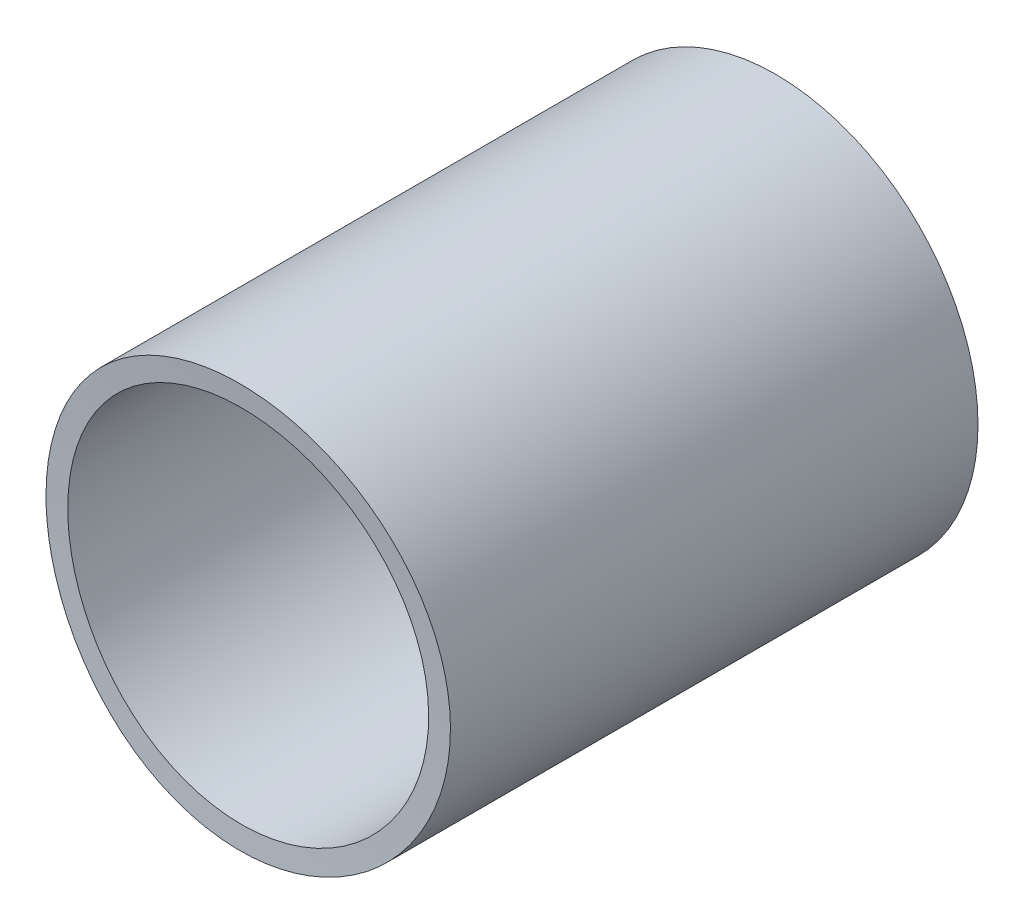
ISO-10303-21;
HEADER;
FILE_DESCRIPTION(('STEP AP214'),'2;1');
FILE_NAME('part.step','',(''),(''),'','','');
FILE_SCHEMA(('AUTOMOTIVE_DESIGN { 1 0 10303 214 1 1 1 1 }'));
ENDSEC;
DATA;
#1=APPLICATION_CONTEXT('core data for automotive mechanical design processes');
#2=APPLICATION_PROTOCOL_DEFINITION('international standard','automotive_design',2000,#1);
#3=PRODUCT_CONTEXT('',#1,'mechanical');
#4=PRODUCT('Part','Part','',(#3));
#5=PRODUCT_RELATED_PRODUCT_CATEGORY('part','',(#4));
#6=PRODUCT_DEFINITION_FORMATION('','',#4);
#7=PRODUCT_DEFINITION_CONTEXT('part definition',#1,'design');
#8=PRODUCT_DEFINITION('design','',#6,#7);
#9=PRODUCT_DEFINITION_SHAPE('','',#8);
#10=(LENGTH_UNIT() NAMED_UNIT(*) SI_UNIT(.MILLI.,.METRE.));
#11=(NAMED_UNIT(*) PLANE_ANGLE_UNIT() SI_UNIT($,.RADIAN.));
#12=(NAMED_UNIT(*) SI_UNIT($,.STERADIAN.) SOLID_ANGLE_UNIT());
#13=UNCERTAINTY_MEASURE_WITH_UNIT(LENGTH_MEASURE(1.E-05),#10,'distance_accuracy_value','');
#14=(GEOMETRIC_REPRESENTATION_CONTEXT(3) GLOBAL_UNCERTAINTY_ASSIGNED_CONTEXT((#13)) GLOBAL_UNIT_ASSIGNED_CONTEXT((#10,
#11,#12)) REPRESENTATION_CONTEXT('',''));
#15=CARTESIAN_POINT('',(0.,0.,0.));
#16=DIRECTION('',(0.,0.,1.));
#17=DIRECTION('',(1.,0.,0.));
#18=AXIS2_PLACEMENT_3D('',#15,#16,#17);
#19=CARTESIAN_POINT('',(-500.,0.,645.001));
#20=DIRECTION('',(0.,0.,-1.));
#21=DIRECTION('',(-1.,0.,0.));
#22=AXIS2_PLACEMENT_3D('',#19,#20,#21);
#23=CYLINDRICAL_SURFACE('',#22,21.55);
#24=CARTESIAN_POINT('',(-521.55,0.,54.9999999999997));
#25=CARTESIAN_POINT('',(-521.550005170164,0.604587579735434,54.9999989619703));
#26=CARTESIAN_POINT('',(-521.524547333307,1.20909356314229,55.0018624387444));
#27=CARTESIAN_POINT('',(-521.422899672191,2.41399844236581,55.0092620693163));
#28=CARTESIAN_POINT('',(-521.346697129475,3.01439627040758,55.0147991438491));
#29=CARTESIAN_POINT('',(-521.143984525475,4.20723602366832,55.0293990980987));
#30=CARTESIAN_POINT('',(-521.017421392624,4.79966887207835,55.03846569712));
#31=CARTESIAN_POINT('',(-520.714913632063,5.97169192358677,55.0598664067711));
#32=CARTESIAN_POINT('',(-520.538972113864,6.55128293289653,55.0722003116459));
#33=CARTESIAN_POINT('',(-520.139074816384,7.69324226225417,55.0997794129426));
#34=CARTESIAN_POINT('',(-519.915144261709,8.25561945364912,55.1150230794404));
#35=CARTESIAN_POINT('',(-519.420813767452,9.35949922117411,55.1479952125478));
#36=CARTESIAN_POINT('',(-519.150413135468,9.90100148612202,55.1657237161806));
#37=CARTESIAN_POINT('',(-518.565139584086,10.9591778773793,55.2031603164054));
#38=CARTESIAN_POINT('',(-518.250276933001,11.4758576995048,55.2228679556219));
#39=CARTESIAN_POINT('',(-517.578267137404,12.4808831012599,55.2637101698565));
#40=CARTESIAN_POINT('',(-517.22112008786,12.9692287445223,55.2848447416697));
#41=CARTESIAN_POINT('',(-516.466398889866,13.9149871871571,55.3279829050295));
#42=CARTESIAN_POINT('',(-516.068754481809,14.3723438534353,55.3499879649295));
#43=CARTESIAN_POINT('',(-515.236376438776,15.2519498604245,55.3942091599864));
#44=CARTESIAN_POINT('',(-514.801642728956,15.6741991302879,55.416425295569));
#45=CARTESIAN_POINT('',(-513.898137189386,16.4806237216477,55.4604404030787));
#46=CARTESIAN_POINT('',(-513.429363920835,16.8647974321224,55.4822393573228));
#47=CARTESIAN_POINT('',(-512.461104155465,17.5923304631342,55.5248011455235));
#48=CARTESIAN_POINT('',(-511.961617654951,17.9356897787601,55.5455639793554));
#49=CARTESIAN_POINT('',(-510.934885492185,18.579514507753,55.5854863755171));
#50=CARTESIAN_POINT('',(-510.407609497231,18.8799316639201,55.6046441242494));
#51=CARTESIAN_POINT('',(-509.329546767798,19.4352697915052,55.6407844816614));
#52=CARTESIAN_POINT('',(-508.778760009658,19.690190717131,55.6577670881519));
#53=CARTESIAN_POINT('',(-507.657594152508,20.1527040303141,55.6890720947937));
#54=CARTESIAN_POINT('',(-507.087215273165,20.3602969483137,55.7033945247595));
#55=CARTESIAN_POINT('',(-505.930920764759,20.7266612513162,55.7289697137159));
#56=CARTESIAN_POINT('',(-505.345005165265,20.8854327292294,55.7402224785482));
#57=CARTESIAN_POINT('',(-504.162883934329,21.1527647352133,55.7593187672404));
#58=CARTESIAN_POINT('',(-503.566698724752,21.2614151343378,55.7671683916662));
#59=CARTESIAN_POINT('',(-502.367261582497,21.4281399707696,55.7792634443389));
#60=CARTESIAN_POINT('',(-501.764009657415,21.4862144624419,55.78350887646));
#61=CARTESIAN_POINT('',(-500.55475154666,21.5513661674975,55.788274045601));
#62=CARTESIAN_POINT('',(-499.948745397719,21.5584440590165,55.7887938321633));
#63=CARTESIAN_POINT('',(-498.738297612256,21.5215529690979,55.7860929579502));
#64=CARTESIAN_POINT('',(-498.133855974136,21.4775840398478,55.7828723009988));
#65=CARTESIAN_POINT('',(-496.932010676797,21.3390520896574,55.7727924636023));
#66=CARTESIAN_POINT('',(-496.334595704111,21.2445866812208,55.7659403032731));
#67=CARTESIAN_POINT('',(-495.14986429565,21.0058047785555,55.7487969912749));
#68=CARTESIAN_POINT('',(-494.562547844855,20.8614883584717,55.7385058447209));
#69=CARTESIAN_POINT('',(-493.402172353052,20.5240409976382,55.7147772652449));
#70=CARTESIAN_POINT('',(-492.829113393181,20.3309097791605,55.7013398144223));
#71=CARTESIAN_POINT('',(-491.701307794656,19.8972163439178,55.6717003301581));
#72=CARTESIAN_POINT('',(-491.146561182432,19.6566540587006,55.6554982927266));
#73=CARTESIAN_POINT('',(-490.05877163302,19.1295610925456,55.6207723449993));
#74=CARTESIAN_POINT('',(-489.525750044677,18.8429864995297,55.60224622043));
#75=CARTESIAN_POINT('',(-488.485734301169,18.226073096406,55.5634096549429));
#76=CARTESIAN_POINT('',(-487.978740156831,17.8957342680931,55.5430992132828));
#77=CARTESIAN_POINT('',(-486.99434199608,17.1936285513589,55.5012686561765));
#78=CARTESIAN_POINT('',(-486.516938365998,16.8218611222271,55.4797485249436));
#79=CARTESIAN_POINT('',(-485.595086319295,16.0395270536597,55.4361070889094));
#80=CARTESIAN_POINT('',(-485.150637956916,15.6289603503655,55.4139857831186));
#81=CARTESIAN_POINT('',(-484.296822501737,14.7709134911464,55.3697146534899));
#82=CARTESIAN_POINT('',(-483.887540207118,14.3233489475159,55.3475648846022));
#83=CARTESIAN_POINT('',(-483.108125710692,13.3953077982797,55.3039167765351));
#84=CARTESIAN_POINT('',(-482.737993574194,12.9148311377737,55.2824184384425));
#85=CARTESIAN_POINT('',(-482.039506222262,11.9243612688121,55.2406825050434));
#86=CARTESIAN_POINT('',(-481.711151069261,11.414368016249,55.2204449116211));
#87=CARTESIAN_POINT('',(-481.098557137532,10.3684737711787,55.1818042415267));
#88=CARTESIAN_POINT('',(-480.814318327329,9.83257279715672,55.1634011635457));
#89=CARTESIAN_POINT('',(-480.291969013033,8.73861767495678,55.1289501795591));
#90=CARTESIAN_POINT('',(-480.053862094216,8.18056180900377,55.1129024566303));
#91=CARTESIAN_POINT('',(-479.62551434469,7.04629983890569,55.0836195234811));
#92=CARTESIAN_POINT('',(-479.435273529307,6.47009372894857,55.0703843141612));
#93=CARTESIAN_POINT('',(-479.104032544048,5.30364225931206,55.0471026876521));
#94=CARTESIAN_POINT('',(-478.963031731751,4.71339708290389,55.0370562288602));
#95=CARTESIAN_POINT('',(-478.731288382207,3.52307360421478,55.0204376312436));
#96=CARTESIAN_POINT('',(-478.640545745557,2.92299532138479,55.0138654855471));
#97=CARTESIAN_POINT('',(-478.510127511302,1.71868536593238,55.0043934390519));
#98=CARTESIAN_POINT('',(-478.470334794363,1.11446644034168,55.0014851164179));
#99=CARTESIAN_POINT('',(-478.441719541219,-0.0951831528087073,54.9993953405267));
#100=CARTESIAN_POINT('',(-478.452896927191,-0.700613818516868,55.0002138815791));
#101=CARTESIAN_POINT('',(-478.526140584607,-1.90836808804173,55.0055546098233));
#102=CARTESIAN_POINT('',(-478.588206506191,-2.51069171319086,55.0100767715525));
#103=CARTESIAN_POINT('',(-478.762777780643,-3.70794629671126,55.0226965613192));
#104=CARTESIAN_POINT('',(-478.875283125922,-4.30287725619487,55.0307941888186));
#105=CARTESIAN_POINT('',(-479.149770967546,-5.4804716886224,55.0503248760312));
#106=CARTESIAN_POINT('',(-479.311699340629,-6.06314783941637,55.06175428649));
#107=CARTESIAN_POINT('',(-479.683912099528,-7.21277468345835,55.0876291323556));
#108=CARTESIAN_POINT('',(-479.89419643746,-7.77972539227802,55.1020745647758));
#109=CARTESIAN_POINT('',(-480.361619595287,-8.89390171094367,55.1335740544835));
#110=CARTESIAN_POINT('',(-480.618758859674,-9.44112713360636,55.1506281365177));
#111=CARTESIAN_POINT('',(-481.178059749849,-10.5119912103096,55.1868640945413));
#112=CARTESIAN_POINT('',(-481.48022146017,-11.0356298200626,55.2060459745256));
#113=CARTESIAN_POINT('',(-482.128012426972,-12.0565628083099,55.2460334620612));
#114=CARTESIAN_POINT('',(-482.473719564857,-12.553807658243,55.2668419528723));
#115=CARTESIAN_POINT('',(-483.205718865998,-13.5174227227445,55.3094641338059));
#116=CARTESIAN_POINT('',(-483.592011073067,-13.9837929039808,55.3312778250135));
#117=CARTESIAN_POINT('',(-484.40245516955,-14.8823777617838,55.3752942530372));
#118=CARTESIAN_POINT('',(-484.826607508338,-15.3145920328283,55.3974969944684));
#119=CARTESIAN_POINT('',(-485.709776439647,-16.1418115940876,55.441663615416));
#120=CARTESIAN_POINT('',(-486.168793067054,-16.5368168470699,55.4636274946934));
#121=CARTESIAN_POINT('',(-487.119361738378,-17.2875431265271,55.5067360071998));
#122=CARTESIAN_POINT('',(-487.610974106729,-17.6431878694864,55.527878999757));
#123=CARTESIAN_POINT('',(-488.622471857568,-18.3117966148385,55.5687001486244));
#124=CARTESIAN_POINT('',(-489.142357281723,-18.6247605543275,55.5883783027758));
#125=CARTESIAN_POINT('',(-490.206715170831,-19.2057719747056,55.6257091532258));
#126=CARTESIAN_POINT('',(-490.751187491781,-19.473819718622,55.6433618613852));
#127=CARTESIAN_POINT('',(-491.860857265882,-19.9630794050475,55.6761382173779));
#128=CARTESIAN_POINT('',(-492.426054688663,-20.1842914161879,55.6912618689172));
#129=CARTESIAN_POINT('',(-493.572594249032,-20.5780952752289,55.7185344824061));
#130=CARTESIAN_POINT('',(-494.15392009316,-20.7507343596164,55.7306863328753));
#131=CARTESIAN_POINT('',(-495.329106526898,-21.0464338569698,55.7516871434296));
#132=CARTESIAN_POINT('',(-495.922967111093,-21.1694942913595,55.760536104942));
#133=CARTESIAN_POINT('',(-497.118979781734,-21.3651444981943,55.7746777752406));
#134=CARTESIAN_POINT('',(-497.721131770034,-21.4377348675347,55.779970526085));
#135=CARTESIAN_POINT('',(-498.929431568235,-21.5319204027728,55.7868482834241));
#136=CARTESIAN_POINT('',(-499.53557937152,-21.5535156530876,55.7884332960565));
#137=CARTESIAN_POINT('',(-500.746114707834,-21.5455638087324,55.7878508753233));
#138=CARTESIAN_POINT('',(-501.350503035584,-21.5161365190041,55.785692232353));
#139=CARTESIAN_POINT('',(-502.554641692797,-21.4065829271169,55.7777010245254));
#140=CARTESIAN_POINT('',(-503.154392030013,-21.3264567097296,55.771868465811));
#141=CARTESIAN_POINT('',(-504.344991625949,-21.1160837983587,55.7566957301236));
#142=CARTESIAN_POINT('',(-504.935840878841,-20.9858370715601,55.7473555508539));
#143=CARTESIAN_POINT('',(-506.104444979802,-20.6761610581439,55.7254335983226));
#144=CARTESIAN_POINT('',(-506.682199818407,-20.4967317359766,55.7128518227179));
#145=CARTESIAN_POINT('',(-507.820505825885,-20.0899844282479,55.6848049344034));
#146=CARTESIAN_POINT('',(-508.381057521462,-19.8626679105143,55.669339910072));
#147=CARTESIAN_POINT('',(-509.481016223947,-19.3617673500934,55.6359652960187));
#148=CARTESIAN_POINT('',(-510.020423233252,-19.0881833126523,55.6180557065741));
#149=CARTESIAN_POINT('',(-511.074279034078,-18.4967010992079,55.5802998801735));
#150=CARTESIAN_POINT('',(-511.588728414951,-18.1788039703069,55.560453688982));
#151=CARTESIAN_POINT('',(-512.589064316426,-17.5009429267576,55.5193856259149));
#152=CARTESIAN_POINT('',(-513.074950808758,-17.1409789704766,55.4981637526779));
#153=CARTESIAN_POINT('',(-514.015790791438,-16.3806815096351,55.4548956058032));
#154=CARTESIAN_POINT('',(-514.470673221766,-15.9802601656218,55.4328476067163));
#155=CARTESIAN_POINT('',(-515.345110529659,-15.1425456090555,55.3885962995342));
#156=CARTESIAN_POINT('',(-515.764665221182,-14.7052522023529,55.3663929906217));
#157=CARTESIAN_POINT('',(-516.565580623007,-13.7967688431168,55.3224542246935));
#158=CARTESIAN_POINT('',(-516.94693178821,-13.3255704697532,55.3007188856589));
#159=CARTESIAN_POINT('',(-517.668613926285,-12.3527081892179,55.2583375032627));
#160=CARTESIAN_POINT('',(-518.00894551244,-11.851044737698,55.2376914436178));
#161=CARTESIAN_POINT('',(-518.646657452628,-10.8200110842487,55.1980429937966));
#162=CARTESIAN_POINT('',(-518.943972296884,-10.2906002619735,55.1790431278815));
#163=CARTESIAN_POINT('',(-519.492928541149,-9.20849340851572,55.1432607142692));
#164=CARTESIAN_POINT('',(-519.744566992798,-8.65579587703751,55.1264783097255));
#165=CARTESIAN_POINT('',(-520.200095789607,-7.53166580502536,55.0956261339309));
#166=CARTESIAN_POINT('',(-520.404036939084,-6.96025394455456,55.0815534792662));
#167=CARTESIAN_POINT('',(-520.762996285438,-5.80240155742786,55.0565011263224));
#168=CARTESIAN_POINT('',(-520.918026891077,-5.21596488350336,55.0455206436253));
#169=CARTESIAN_POINT('',(-521.214697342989,-3.86546999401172,55.0243522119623));
#170=CARTESIAN_POINT('',(-521.3403217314,-3.0978228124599,55.0152547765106));
#171=CARTESIAN_POINT('',(-521.507969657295,-1.55340552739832,55.0030793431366));
#172=CARTESIAN_POINT('',(-521.54999335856,-0.776635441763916,55.0000013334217));
#173=CARTESIAN_POINT('',(-521.55,0.,54.9999999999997));
#174=B_SPLINE_CURVE_WITH_KNOTS('',3,(#24,#25,#26,#27,#28,#29,#30,#31,#32,#33,#34,#35,#36,#37,
#38,#39,#40,#41,#42,#43,#44,#45,#46,#47,#48,#49,#50,#51,#52,#53,#54,#55,#56,#57,#58,#59,#60,#61,
#62,#63,#64,#65,#66,#67,#68,#69,#70,#71,#72,#73,#74,#75,#76,#77,#78,#79,#80,#81,#82,#83,#84,#85,
#86,#87,#88,#89,#90,#91,#92,#93,#94,#95,#96,#97,#98,#99,#100,#101,#102,#103,#104,#105,#106,#107,
#108,#109,#110,#111,#112,#113,#114,#115,#116,#117,#118,#119,#120,#121,#122,#123,#124,#125,#126,
#127,#128,#129,#130,#131,#132,#133,#134,#135,#136,#137,#138,#139,#140,#141,#142,#143,#144,#145,
#146,#147,#148,#149,#150,#151,#152,#153,#154,#155,#156,#157,#158,#159,#160,#161,#162,#163,#164,
#165,#166,#167,#168,#169,#170,#171,#172,#173),.UNSPECIFIED.,.T.,.F.,(4,2,2,2,2,2,2,2,2,2,2,2,2,
2,2,2,2,2,2,2,2,2,2,2,2,2,2,2,2,2,2,2,2,2,2,2,2,2,2,2,2,2,2,2,2,2,2,2,2,2,2,2,2,2,2,2,2,2,2,2,2,
2,2,2,2,2,2,2,2,2,2,2,2,2,4),(0.,1.81308394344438,3.62662248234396,5.44207726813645,
7.25741775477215,9.07180636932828,10.8862220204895,12.7002193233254,14.5142125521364,
16.3314083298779,18.148607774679,19.9658840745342,21.7831605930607,23.60246352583,
25.4217682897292,27.2410526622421,29.0603335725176,30.876339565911,32.6923436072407,
34.5083234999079,36.3243015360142,38.1367818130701,39.9492593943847,41.7617472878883,
43.5742377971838,45.388468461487,47.2026998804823,49.0169549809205,50.831213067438,
52.6497299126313,54.4682497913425,56.2867723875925,58.1052936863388,59.9239562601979,
61.7426194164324,63.5612588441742,65.3798946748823,67.1943424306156,69.008787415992,
70.8232199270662,72.6376521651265,74.4501045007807,76.2625550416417,78.0750227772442,
79.8874939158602,81.7032539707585,83.5190159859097,85.3347995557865,87.1505849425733,
88.9698300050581,90.7890777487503,92.6083148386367,94.4275492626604,96.245008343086,
98.0624666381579,99.8799034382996,101.697337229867,103.510509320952,105.323678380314,
107.136848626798,108.950020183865,110.763136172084,112.576251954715,114.389324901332,
116.202399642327,118.019499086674,119.836608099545,121.654169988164,123.471704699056,
125.291978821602,127.112370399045,128.930814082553,130.748796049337,133.077834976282,
135.406869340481),.UNSPECIFIED.);
#175=CARTESIAN_POINT('',(-521.55,0.,54.9999999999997));
#176=VERTEX_POINT('',#175);
#177=EDGE_CURVE('E53',#176,#176,#174,.T.);
#178=ORIENTED_EDGE('',*,*,#177,.F.);
#179=EDGE_LOOP('',(#178));
#180=FACE_BOUND('',#179,.T.);
#181=CARTESIAN_POINT('',(-500.,0.,-8.00000000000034));
#182=DIRECTION('',(0.,0.,1.));
#183=DIRECTION('',(1.,0.,0.));
#184=AXIS2_PLACEMENT_3D('',#181,#182,#183);
#185=CIRCLE('',#184,21.55);
#186=CARTESIAN_POINT('',(-478.45,0.,-8.00000000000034));
#187=VERTEX_POINT('',#186);
#188=EDGE_CURVE('E49',#187,#187,#185,.T.);
#189=ORIENTED_EDGE('',*,*,#188,.F.);
#190=EDGE_LOOP('',(#189));
#191=FACE_BOUND('',#190,.T.);
#192=ADVANCED_FACE('F37',(#180,#191),#23,.F.);
#193=CARTESIAN_POINT('',(-500.,0.,-8.00000000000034));
#194=DIRECTION('',(0.,0.,1.));
#195=DIRECTION('',(1.,0.,0.));
#196=AXIS2_PLACEMENT_3D('',#193,#194,#195);
#197=PLANE('',#196);
#198=CARTESIAN_POINT('',(-500.,0.,-8.00000000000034));
#199=DIRECTION('',(0.,0.,1.));
#200=DIRECTION('',(1.,0.,0.));
#201=AXIS2_PLACEMENT_3D('',#198,#199,#200);
#202=CIRCLE('',#201,24.15);
#203=CARTESIAN_POINT('',(-475.85,0.,-8.00000000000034));
#204=VERTEX_POINT('',#203);
#205=EDGE_CURVE('E11',#204,#204,#202,.T.);
#206=ORIENTED_EDGE('',*,*,#205,.F.);
#207=EDGE_LOOP('',(#206));
#208=FACE_BOUND('',#207,.T.);
#209=ORIENTED_EDGE('',*,*,#188,.T.);
#210=EDGE_LOOP('',(#209));
#211=FACE_BOUND('',#210,.T.);
#212=ADVANCED_FACE('F69',(#208,#211),#197,.F.);
#213=CARTESIAN_POINT('',(-500.,0.,645.001));
#214=DIRECTION('',(0.,0.,-1.));
#215=DIRECTION('',(-1.,0.,0.));
#216=AXIS2_PLACEMENT_3D('',#213,#214,#215);
#217=CYLINDRICAL_SURFACE('',#216,24.15);
#218=CARTESIAN_POINT('',(-524.15,0.,54.9999999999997));
#219=CARTESIAN_POINT('',(-524.150006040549,0.677282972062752,54.9999986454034));
#220=CARTESIAN_POINT('',(-524.121497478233,1.35447154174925,55.0023372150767));
#221=CARTESIAN_POINT('',(-524.007670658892,2.70424431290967,55.0116232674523));
#222=CARTESIAN_POINT('',(-523.922338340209,3.376827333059,55.0185718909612));
#223=CARTESIAN_POINT('',(-523.695343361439,4.71306697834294,55.0368937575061));
#224=CARTESIAN_POINT('',(-523.553622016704,5.37671355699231,55.0482716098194));
#225=CARTESIAN_POINT('',(-523.214889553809,6.68961668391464,55.0751280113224));
#226=CARTESIAN_POINT('',(-523.017881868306,7.33887412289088,55.0906063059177));
#227=CARTESIAN_POINT('',(-522.570115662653,8.6180830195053,55.125216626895));
#228=CARTESIAN_POINT('',(-522.319386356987,9.24804475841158,55.1443466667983));
#229=CARTESIAN_POINT('',(-521.765907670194,10.4845893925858,55.1857260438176));
#230=CARTESIAN_POINT('',(-521.463157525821,11.0911719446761,55.2079754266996));
#231=CARTESIAN_POINT('',(-520.807872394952,12.276541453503,55.2549604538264));
#232=CARTESIAN_POINT('',(-520.455348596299,12.855334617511,55.2796955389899));
#233=CARTESIAN_POINT('',(-519.702965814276,13.9812036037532,55.330959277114));
#234=CARTESIAN_POINT('',(-519.303106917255,14.528279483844,55.3574879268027));
#235=CARTESIAN_POINT('',(-518.457951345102,15.5880363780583,55.411651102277));
#236=CARTESIAN_POINT('',(-518.012557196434,16.1006395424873,55.4392879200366));
#237=CARTESIAN_POINT('',(-517.080206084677,17.0865261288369,55.4948311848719));
#238=CARTESIAN_POINT('',(-516.593249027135,17.5598094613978,55.5227376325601));
#239=CARTESIAN_POINT('',(-515.581183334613,18.4637370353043,55.5780315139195));
#240=CARTESIAN_POINT('',(-515.056073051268,18.8943794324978,55.605418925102));
#241=CARTESIAN_POINT('',(-513.971418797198,19.7099560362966,55.6588973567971));
#242=CARTESIAN_POINT('',(-513.41187481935,20.0948902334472,55.6849883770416));
#243=CARTESIAN_POINT('',(-512.261486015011,20.8168262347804,55.7351687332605));
#244=CARTESIAN_POINT('',(-511.670598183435,21.1537597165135,55.7592551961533));
#245=CARTESIAN_POINT('',(-510.462430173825,21.7766380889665,55.8046981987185));
#246=CARTESIAN_POINT('',(-509.845149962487,22.0625829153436,55.826054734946));
#247=CARTESIAN_POINT('',(-508.588589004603,22.5814230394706,55.8654269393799));
#248=CARTESIAN_POINT('',(-507.949308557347,22.8143190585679,55.8834426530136));
#249=CARTESIAN_POINT('',(-506.653293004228,23.2253815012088,55.9156172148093));
#250=CARTESIAN_POINT('',(-505.996557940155,23.4035480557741,55.9297760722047));
#251=CARTESIAN_POINT('',(-504.671822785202,23.7035178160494,55.9538031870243));
#252=CARTESIAN_POINT('',(-504.003851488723,23.8254474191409,55.9636810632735));
#253=CARTESIAN_POINT('',(-502.659965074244,24.0126498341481,55.9789097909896));
#254=CARTESIAN_POINT('',(-501.984049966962,24.0779227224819,55.9842606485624));
#255=CARTESIAN_POINT('',(-500.629114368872,24.1513357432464,55.990281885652));
#256=CARTESIAN_POINT('',(-499.950093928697,24.1594768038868,55.9909523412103));
#257=CARTESIAN_POINT('',(-498.593790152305,24.1185692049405,55.9875937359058));
#258=CARTESIAN_POINT('',(-497.916506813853,24.0695206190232,55.9835646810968));
#259=CARTESIAN_POINT('',(-496.57015064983,23.9147794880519,55.9709379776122));
#260=CARTESIAN_POINT('',(-495.901061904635,23.8092245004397,55.9623514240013));
#261=CARTESIAN_POINT('',(-494.574178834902,23.5423220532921,55.9408614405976));
#262=CARTESIAN_POINT('',(-493.916384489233,23.3809746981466,55.9279580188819));
#263=CARTESIAN_POINT('',(-492.616743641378,23.0036495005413,55.8982014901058));
#264=CARTESIAN_POINT('',(-491.974897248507,22.7876712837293,55.8813483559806));
#265=CARTESIAN_POINT('',(-490.711688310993,22.3026345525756,55.844171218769));
#266=CARTESIAN_POINT('',(-490.090325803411,22.0335759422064,55.8238472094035));
#267=CARTESIAN_POINT('',(-488.871726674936,21.4439442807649,55.7802781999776));
#268=CARTESIAN_POINT('',(-488.274519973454,21.1233096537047,55.7570297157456));
#269=CARTESIAN_POINT('',(-487.109227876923,20.433039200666,55.7082900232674));
#270=CARTESIAN_POINT('',(-486.541142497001,20.0634033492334,55.6827988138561));
#271=CARTESIAN_POINT('',(-485.438073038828,19.2777409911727,55.6302942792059));
#272=CARTESIAN_POINT('',(-484.90308950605,18.861713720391,55.603280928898));
#273=CARTESIAN_POINT('',(-483.869986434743,17.9862063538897,55.5484951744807));
#274=CARTESIAN_POINT('',(-483.371866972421,17.5267261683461,55.5207227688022));
#275=CARTESIAN_POINT('',(-482.414576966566,16.566126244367,55.4651200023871));
#276=CARTESIAN_POINT('',(-481.95552568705,16.0648876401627,55.4372897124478));
#277=CARTESIAN_POINT('',(-481.081268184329,15.0254869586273,55.382441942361));
#278=CARTESIAN_POINT('',(-480.666062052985,14.4873248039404,55.3554244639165));
#279=CARTESIAN_POINT('',(-479.8824401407,13.3778742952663,55.3029677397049));
#280=CARTESIAN_POINT('',(-479.514024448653,12.8065858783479,55.2775284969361));
#281=CARTESIAN_POINT('',(-478.826609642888,11.6349204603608,55.2289492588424));
#282=CARTESIAN_POINT('',(-478.507610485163,11.0345434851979,55.2058092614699));
#283=CARTESIAN_POINT('',(-477.921282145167,9.80888719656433,55.1624824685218));
#284=CARTESIAN_POINT('',(-477.653958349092,9.18360529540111,55.142295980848));
#285=CARTESIAN_POINT('',(-477.172947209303,7.9126381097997,55.1054522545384));
#286=CARTESIAN_POINT('',(-476.959259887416,7.26695281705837,55.088795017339));
#287=CARTESIAN_POINT('',(-476.587071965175,5.95978962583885,55.0594835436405));
#288=CARTESIAN_POINT('',(-476.428570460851,5.29831198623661,55.0468292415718));
#289=CARTESIAN_POINT('',(-476.167902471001,3.96428060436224,55.0258833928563));
#290=CARTESIAN_POINT('',(-476.06573584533,3.29172688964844,55.0175918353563));
#291=CARTESIAN_POINT('',(-475.918695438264,1.94231215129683,55.0056248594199));
#292=CARTESIAN_POINT('',(-475.873657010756,1.26546918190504,55.0019361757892));
#293=CARTESIAN_POINT('',(-475.840658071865,-0.089615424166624,54.999235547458));
#294=CARTESIAN_POINT('',(-475.852697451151,-0.767857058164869,55.0002235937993));
#295=CARTESIAN_POINT('',(-475.93376604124,-2.12089655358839,55.0068483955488));
#296=CARTESIAN_POINT('',(-476.00279475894,-2.79569444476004,55.0124851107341));
#297=CARTESIAN_POINT('',(-476.197339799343,-4.13704410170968,55.0282475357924));
#298=CARTESIAN_POINT('',(-476.322856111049,-4.8035958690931,55.0383732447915));
#299=CARTESIAN_POINT('',(-476.629255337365,-6.12280260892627,55.0628101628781));
#300=CARTESIAN_POINT('',(-476.810061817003,-6.77547544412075,55.0771155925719));
#301=CARTESIAN_POINT('',(-477.225797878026,-8.06325111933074,55.1095137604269));
#302=CARTESIAN_POINT('',(-477.4607273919,-8.69835398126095,55.1276064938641));
#303=CARTESIAN_POINT('',(-477.98303005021,-9.94651794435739,55.1670698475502));
#304=CARTESIAN_POINT('',(-478.270403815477,-10.5595787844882,55.1884405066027));
#305=CARTESIAN_POINT('',(-478.895546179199,-11.7593405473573,55.2338582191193));
#306=CARTESIAN_POINT('',(-479.233314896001,-12.3460414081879,55.2579052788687));
#307=CARTESIAN_POINT('',(-479.95767552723,-13.4902652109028,55.3080566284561));
#308=CARTESIAN_POINT('',(-480.344376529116,-14.0477188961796,55.334165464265));
#309=CARTESIAN_POINT('',(-481.163258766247,-15.1280905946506,55.3876556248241));
#310=CARTESIAN_POINT('',(-481.595440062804,-15.6510085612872,55.4150369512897));
#311=CARTESIAN_POINT('',(-482.502239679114,-16.6586401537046,55.4702996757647));
#312=CARTESIAN_POINT('',(-482.976858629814,-17.1433532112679,55.4981810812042));
#313=CARTESIAN_POINT('',(-483.965187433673,-18.071156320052,55.5536562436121));
#314=CARTESIAN_POINT('',(-484.478897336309,-18.5142463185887,55.5812500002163));
#315=CARTESIAN_POINT('',(-485.543073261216,-19.3566891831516,55.6354348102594));
#316=CARTESIAN_POINT('',(-486.093624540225,-19.7559345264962,55.6620232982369));
#317=CARTESIAN_POINT('',(-487.226487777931,-20.5066236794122,55.7133710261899));
#318=CARTESIAN_POINT('',(-487.808799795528,-20.8580674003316,55.738130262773));
#319=CARTESIAN_POINT('',(-489.001059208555,-21.5106399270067,55.785113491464));
#320=CARTESIAN_POINT('',(-489.611006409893,-21.811769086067,55.8073375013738));
#321=CARTESIAN_POINT('',(-490.854212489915,-22.3615523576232,55.848615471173));
#322=CARTESIAN_POINT('',(-491.487471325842,-22.610206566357,55.8676694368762));
#323=CARTESIAN_POINT('',(-492.772016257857,-23.0529763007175,55.9020408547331));
#324=CARTESIAN_POINT('',(-493.423279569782,-23.2471575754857,55.9173628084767));
#325=CARTESIAN_POINT('',(-494.739931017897,-23.5799757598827,55.9438614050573));
#326=CARTESIAN_POINT('',(-495.405319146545,-23.7186126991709,55.9550380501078));
#327=CARTESIAN_POINT('',(-496.745459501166,-23.9393323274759,55.972925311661));
#328=CARTESIAN_POINT('',(-497.420211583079,-24.021415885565,55.9796359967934));
#329=CARTESIAN_POINT('',(-498.774262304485,-24.1284332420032,55.9883988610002));
#330=CARTESIAN_POINT('',(-499.453560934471,-24.1533671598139,55.9904510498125));
#331=CARTESIAN_POINT('',(-500.809836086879,-24.1459146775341,55.989838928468));
#332=CARTESIAN_POINT('',(-501.486813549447,-24.1136971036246,55.9871885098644));
#333=CARTESIAN_POINT('',(-502.835633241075,-23.9925026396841,55.977273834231));
#334=CARTESIAN_POINT('',(-503.507475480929,-23.9035258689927,55.9700095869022));
#335=CARTESIAN_POINT('',(-504.841248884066,-23.6694580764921,55.9510746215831));
#336=CARTESIAN_POINT('',(-505.503180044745,-23.5243670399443,55.9394039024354));
#337=CARTESIAN_POINT('',(-506.812435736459,-23.1791189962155,55.9119886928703));
#338=CARTESIAN_POINT('',(-507.459760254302,-22.9789619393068,55.8962441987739));
#339=CARTESIAN_POINT('',(-508.735186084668,-22.5250347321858,55.8611304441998));
#340=CARTESIAN_POINT('',(-509.363288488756,-22.2712676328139,55.8417613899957));
#341=CARTESIAN_POINT('',(-510.595879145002,-21.7119294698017,55.7999477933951));
#342=CARTESIAN_POINT('',(-511.200367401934,-21.4063584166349,55.7775032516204));
#343=CARTESIAN_POINT('',(-512.381468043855,-20.7455933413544,55.7301748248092));
#344=CARTESIAN_POINT('',(-512.9580809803,-20.3904003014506,55.7052909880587));
#345=CARTESIAN_POINT('',(-514.079399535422,-19.6329010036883,55.6537867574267));
#346=CARTESIAN_POINT('',(-514.624105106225,-19.2305946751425,55.6271663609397));
#347=CARTESIAN_POINT('',(-515.679276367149,-18.3805084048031,55.5728634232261));
#348=CARTESIAN_POINT('',(-516.189641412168,-17.9326037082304,55.5451781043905));
#349=CARTESIAN_POINT('',(-517.170853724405,-16.9954275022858,55.4895999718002));
#350=CARTESIAN_POINT('',(-517.641700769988,-16.5061557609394,55.4617071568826));
#351=CARTESIAN_POINT('',(-518.540664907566,-15.4895691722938,55.4064963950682));
#352=CARTESIAN_POINT('',(-518.968771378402,-14.9622449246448,55.3791785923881));
#353=CARTESIAN_POINT('',(-519.779085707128,-13.8733853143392,55.3258982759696));
#354=CARTESIAN_POINT('',(-520.16129424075,-13.3118504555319,55.2999357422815));
#355=CARTESIAN_POINT('',(-520.877746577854,-12.1574866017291,55.2500554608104));
#356=CARTESIAN_POINT('',(-521.211903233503,-11.5646033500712,55.2261414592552));
#357=CARTESIAN_POINT('',(-521.829060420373,-10.3526375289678,55.1810884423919));
#358=CARTESIAN_POINT('',(-522.112057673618,-9.73355328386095,55.1599496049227));
#359=CARTESIAN_POINT('',(-522.624560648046,-8.47427420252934,55.1210706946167));
#360=CARTESIAN_POINT('',(-522.854122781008,-7.83410245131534,55.103327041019));
#361=CARTESIAN_POINT('',(-523.258423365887,-6.53680871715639,55.0717184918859));
#362=CARTESIAN_POINT('',(-523.433175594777,-5.87969103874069,55.0578526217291));
#363=CARTESIAN_POINT('',(-523.769156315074,-4.36083386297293,55.030994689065));
#364=CARTESIAN_POINT('',(-523.911840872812,-3.49490316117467,55.019416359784));
#365=CARTESIAN_POINT('',(-524.102258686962,-1.75259562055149,55.0039199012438));
#366=CARTESIAN_POINT('',(-524.149992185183,-0.876218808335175,55.0000017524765));
#367=CARTESIAN_POINT('',(-524.15,0.,54.9999999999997));
#368=B_SPLINE_CURVE_WITH_KNOTS('',3,(#218,#219,#220,#221,#222,#223,#224,#225,#226,#227,#228,
#229,#230,#231,#232,#233,#234,#235,#236,#237,#238,#239,#240,#241,#242,#243,#244,#245,#246,#247,
#248,#249,#250,#251,#252,#253,#254,#255,#256,#257,#258,#259,#260,#261,#262,#263,#264,#265,#266,
#267,#268,#269,#270,#271,#272,#273,#274,#275,#276,#277,#278,#279,#280,#281,#282,#283,#284,#285,
#286,#287,#288,#289,#290,#291,#292,#293,#294,#295,#296,#297,#298,#299,#300,#301,#302,#303,#304,
#305,#306,#307,#308,#309,#310,#311,#312,#313,#314,#315,#316,#317,#318,#319,#320,#321,#322,#323,
#324,#325,#326,#327,#328,#329,#330,#331,#332,#333,#334,#335,#336,#337,#338,#339,#340,#341,#342,
#343,#344,#345,#346,#347,#348,#349,#350,#351,#352,#353,#354,#355,#356,#357,#358,#359,#360,#361,
#362,#363,#364,#365,#366,#367),.UNSPECIFIED.,.T.,.F.,(4,2,2,2,2,2,2,2,2,2,2,2,2,2,2,2,2,2,2,2,2,
2,2,2,2,2,2,2,2,2,2,2,2,2,2,2,2,2,2,2,2,2,2,2,2,2,2,2,2,2,2,2,2,2,2,2,2,2,2,2,2,2,2,2,2,2,2,2,2,
2,2,2,2,2,4),(0.,2.03108296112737,4.06266872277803,6.09637433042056,8.12995369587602,
10.1624299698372,12.1949360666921,14.2269860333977,16.2590322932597,18.2955232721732,
20.3320188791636,22.3686025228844,24.40518658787,26.4446410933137,28.4840981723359,
30.5235275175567,32.5629519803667,34.5977700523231,36.6325853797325,38.6673676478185,
40.7021472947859,42.7319959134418,44.7618407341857,46.7916994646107,48.8215618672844,
50.8538659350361,52.8861710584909,54.9185096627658,56.9508524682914,58.9891921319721,
61.0275360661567,63.0658838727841,65.1042298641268,67.1427882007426,69.1813473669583,
71.2198731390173,73.258393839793,75.2910259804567,77.3236542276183,79.3562648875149,
81.3888751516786,83.418688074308,85.4484984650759,87.4783328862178,89.5081720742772,
91.5426189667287,93.5770686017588,95.6115484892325,97.6460309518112,99.6853962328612,
101.724765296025,103.764120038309,105.803471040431,107.840349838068,109.87722754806,
111.914073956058,113.950916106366,115.981751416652,118.012582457,120.043414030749,
122.074247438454,124.104965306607,126.135682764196,128.166360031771,130.19704034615,
132.233433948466,134.26983897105,136.306748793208,138.343628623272,140.384157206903,
142.424816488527,144.463311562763,146.501293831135,149.128966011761,151.756631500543),.UNSPECIFIED.);
#369=CARTESIAN_POINT('',(-524.15,0.,54.9999999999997));
#370=VERTEX_POINT('',#369);
#371=EDGE_CURVE('E42',#370,#370,#368,.T.);
#372=ORIENTED_EDGE('',*,*,#371,.T.);
#373=EDGE_LOOP('',(#372));
#374=FACE_BOUND('',#373,.T.);
#375=ORIENTED_EDGE('',*,*,#205,.T.);
#376=EDGE_LOOP('',(#375));
#377=FACE_BOUND('',#376,.T.);
#378=ADVANCED_FACE('F39',(#374,#377),#217,.T.);
#379=CARTESIAN_POINT('',(-540.,0.,350.));
#380=DIRECTION('',(1.,0.,0.));
#381=DIRECTION('',(0.,0.,-1.));
#382=AXIS2_PLACEMENT_3D('',#379,#380,#381);
#383=CYLINDRICAL_SURFACE('',#382,295.);
#384=ORIENTED_EDGE('',*,*,#177,.T.);
#385=EDGE_LOOP('',(#384));
#386=FACE_BOUND('',#385,.T.);
#387=ORIENTED_EDGE('',*,*,#371,.F.);
#388=EDGE_LOOP('',(#387));
#389=FACE_BOUND('',#388,.T.);
#390=ADVANCED_FACE('F61',(#386,#389),#383,.F.);
#391=CLOSED_SHELL('',(#192,#212,#378,#390));
#392=MANIFOLD_SOLID_BREP('B2',#391);
#393=ADVANCED_BREP_SHAPE_REPRESENTATION('',(#18,#392),#14);
#394=SHAPE_DEFINITION_REPRESENTATION(#9,#393);
ENDSEC;
END-ISO-10303-21;
